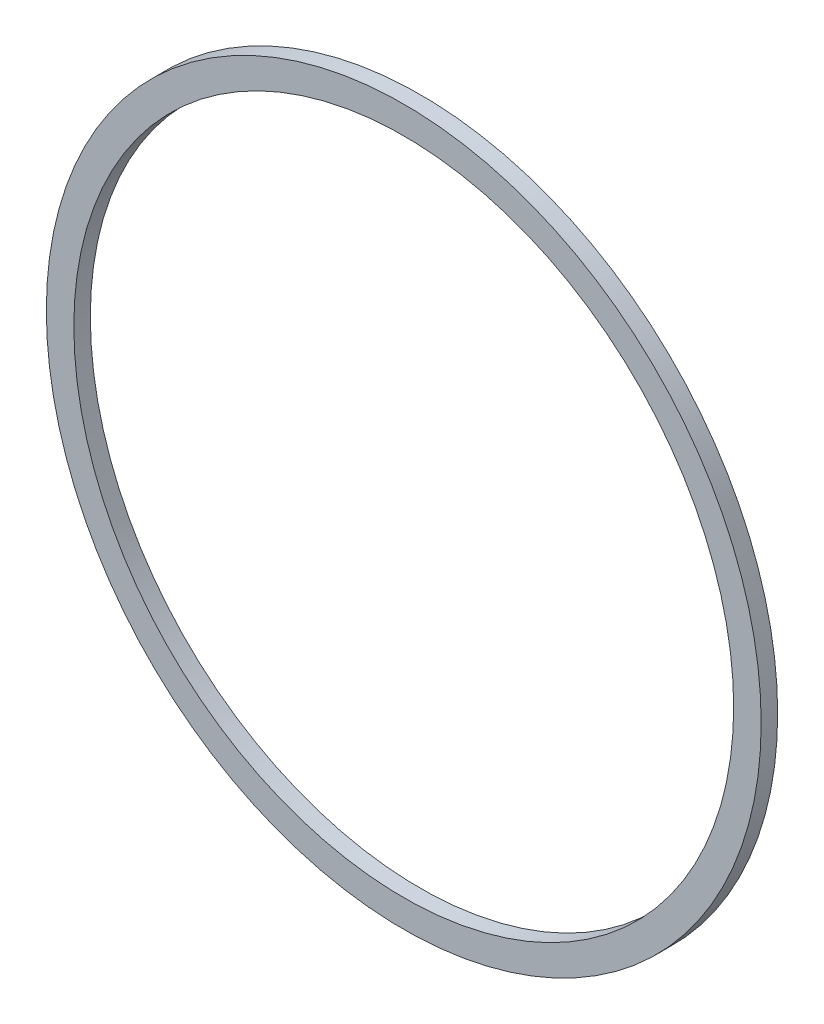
ISO-10303-21;
HEADER;
FILE_DESCRIPTION(('STEP AP214'),'2;1');
FILE_NAME('part.step','',(''),(''),'','','');
FILE_SCHEMA(('AUTOMOTIVE_DESIGN { 1 0 10303 214 1 1 1 1 }'));
ENDSEC;
DATA;
#1=APPLICATION_CONTEXT('core data for automotive mechanical design processes');
#2=APPLICATION_PROTOCOL_DEFINITION('international standard','automotive_design',2000,#1);
#3=PRODUCT_CONTEXT('',#1,'mechanical');
#4=PRODUCT('Part','Part','',(#3));
#5=PRODUCT_RELATED_PRODUCT_CATEGORY('part','',(#4));
#6=PRODUCT_DEFINITION_FORMATION('','',#4);
#7=PRODUCT_DEFINITION_CONTEXT('part definition',#1,'design');
#8=PRODUCT_DEFINITION('design','',#6,#7);
#9=PRODUCT_DEFINITION_SHAPE('','',#8);
#10=(LENGTH_UNIT() NAMED_UNIT(*) SI_UNIT(.MILLI.,.METRE.));
#11=(NAMED_UNIT(*) PLANE_ANGLE_UNIT() SI_UNIT($,.RADIAN.));
#12=(NAMED_UNIT(*) SI_UNIT($,.STERADIAN.) SOLID_ANGLE_UNIT());
#13=UNCERTAINTY_MEASURE_WITH_UNIT(LENGTH_MEASURE(1.E-05),#10,'distance_accuracy_value','');
#14=(GEOMETRIC_REPRESENTATION_CONTEXT(3) GLOBAL_UNCERTAINTY_ASSIGNED_CONTEXT((#13)) GLOBAL_UNIT_ASSIGNED_CONTEXT((#10,
#11,#12)) REPRESENTATION_CONTEXT('',''));
#15=CARTESIAN_POINT('',(0.,0.,0.));
#16=DIRECTION('',(0.,0.,1.));
#17=DIRECTION('',(1.,0.,0.));
#18=AXIS2_PLACEMENT_3D('',#15,#16,#17);
#19=CARTESIAN_POINT('',(0.,0.,1.5));
#20=DIRECTION('',(0.,0.,1.));
#21=DIRECTION('',(1.,0.,0.));
#22=AXIS2_PLACEMENT_3D('',#19,#20,#21);
#23=PLANE('',#22);
#24=CARTESIAN_POINT('',(0.,0.,1.5));
#25=DIRECTION('',(0.,0.,1.));
#26=DIRECTION('',(1.,0.,0.));
#27=AXIS2_PLACEMENT_3D('',#24,#25,#26);
#28=CIRCLE('',#27,32.5);
#29=CARTESIAN_POINT('',(32.5,0.,1.5));
#30=VERTEX_POINT('',#29);
#31=EDGE_CURVE('E10',#30,#30,#28,.T.);
#32=ORIENTED_EDGE('',*,*,#31,.T.);
#33=EDGE_LOOP('',(#32));
#34=FACE_BOUND('',#33,.T.);
#35=CARTESIAN_POINT('',(0.,0.,1.5));
#36=DIRECTION('',(0.,0.,1.));
#37=DIRECTION('',(1.,0.,0.));
#38=AXIS2_PLACEMENT_3D('',#35,#36,#37);
#39=CIRCLE('',#38,30.);
#40=CARTESIAN_POINT('',(30.,0.,1.5));
#41=VERTEX_POINT('',#40);
#42=EDGE_CURVE('E40',#41,#41,#39,.T.);
#43=ORIENTED_EDGE('',*,*,#42,.F.);
#44=EDGE_LOOP('',(#43));
#45=FACE_BOUND('',#44,.T.);
#46=ADVANCED_FACE('F29',(#34,#45),#23,.T.);
#47=CARTESIAN_POINT('',(0.,0.,0.));
#48=DIRECTION('',(0.,0.,1.));
#49=DIRECTION('',(1.,0.,0.));
#50=AXIS2_PLACEMENT_3D('',#47,#48,#49);
#51=PLANE('',#50);
#52=CARTESIAN_POINT('',(0.,0.,0.));
#53=DIRECTION('',(0.,0.,1.));
#54=DIRECTION('',(1.,0.,0.));
#55=AXIS2_PLACEMENT_3D('',#52,#53,#54);
#56=CIRCLE('',#55,32.5);
#57=CARTESIAN_POINT('',(32.5,0.,0.));
#58=VERTEX_POINT('',#57);
#59=EDGE_CURVE('E33',#58,#58,#56,.T.);
#60=ORIENTED_EDGE('',*,*,#59,.F.);
#61=EDGE_LOOP('',(#60));
#62=FACE_BOUND('',#61,.T.);
#63=CARTESIAN_POINT('',(0.,0.,0.));
#64=DIRECTION('',(0.,0.,1.));
#65=DIRECTION('',(1.,0.,0.));
#66=AXIS2_PLACEMENT_3D('',#63,#64,#65);
#67=CIRCLE('',#66,30.);
#68=CARTESIAN_POINT('',(30.,0.,0.));
#69=VERTEX_POINT('',#68);
#70=EDGE_CURVE('E42',#69,#69,#67,.T.);
#71=ORIENTED_EDGE('',*,*,#70,.T.);
#72=EDGE_LOOP('',(#71));
#73=FACE_BOUND('',#72,.T.);
#74=ADVANCED_FACE('F52',(#62,#73),#51,.F.);
#75=CARTESIAN_POINT('',(0.,0.,1.5));
#76=DIRECTION('',(0.,0.,-1.));
#77=DIRECTION('',(-1.,0.,0.));
#78=AXIS2_PLACEMENT_3D('',#75,#76,#77);
#79=CYLINDRICAL_SURFACE('',#78,32.5);
#80=ORIENTED_EDGE('',*,*,#31,.F.);
#81=EDGE_LOOP('',(#80));
#82=FACE_BOUND('',#81,.T.);
#83=ORIENTED_EDGE('',*,*,#59,.T.);
#84=EDGE_LOOP('',(#83));
#85=FACE_BOUND('',#84,.T.);
#86=ADVANCED_FACE('F31',(#82,#85),#79,.T.);
#87=CARTESIAN_POINT('',(0.,0.,1.5));
#88=DIRECTION('',(0.,0.,-1.));
#89=DIRECTION('',(-1.,0.,0.));
#90=AXIS2_PLACEMENT_3D('',#87,#88,#89);
#91=CYLINDRICAL_SURFACE('',#90,30.);
#92=ORIENTED_EDGE('',*,*,#42,.T.);
#93=EDGE_LOOP('',(#92));
#94=FACE_BOUND('',#93,.T.);
#95=ORIENTED_EDGE('',*,*,#70,.F.);
#96=EDGE_LOOP('',(#95));
#97=FACE_BOUND('',#96,.T.);
#98=ADVANCED_FACE('F48',(#94,#97),#91,.F.);
#99=CLOSED_SHELL('',(#46,#74,#86,#98));
#100=MANIFOLD_SOLID_BREP('B2',#99);
#101=ADVANCED_BREP_SHAPE_REPRESENTATION('',(#18,#100),#14);
#102=SHAPE_DEFINITION_REPRESENTATION(#9,#101);
ENDSEC;
END-ISO-10303-21;
